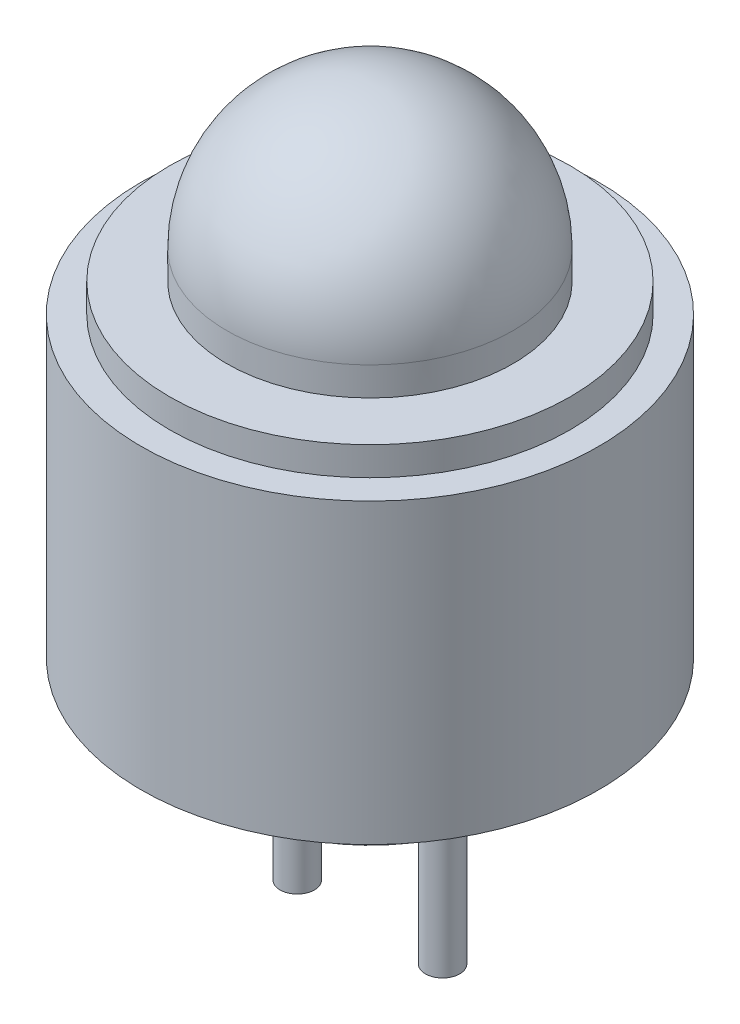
from build123d import *

# Parameters (mm, degrees)
SKETCH_2_R      = 0.3
EXTRUDE_1_DEPTH = 3


with BuildPart() as part:
    # Sketch 1 → Revolve 1 (revolve)
    with BuildSketch(Plane.XY, mode=Mode.PRIVATE) as revolve_1_sk:
        with BuildLine():
            Line((0, 0), (2.6, 0))
            Line((2.6, 0), (2.6, 1))
            Line((2.6, 1), (4, 1))
            Line((4, 1), (4, 6.2))
            Line((4, 6.2), (3.5, 6.2))
            Line((3.5, 6.2), (3.5, 6.7))
            Line((3.5, 6.7), (2.5, 6.7))
            Line((2.5, 6.7), (2.5, 7.2))
            ThreePointArc((2.5, 7.2), (1.767766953, 8.967766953), (0, 9.7))
            Line((0, 9.7), (0, 0))
        make_face()
    revolve(revolve_1_sk.sketch.rotate(Axis((0, 9.7, 0), (0, -1, 0)), 180), axis=Axis((0, 9.7, 0), (0, -1, 0)))

    # Sketch 2 → Extrude 1 (add)
    with BuildSketch(Plane.XZ):
        with Locations(Location((-1.27, 0, 0), (0, 0, 180))):
            Circle(SKETCH_2_R)
        with Locations(Location((1.27, 0, 0), (0, 0, 180))):
            Circle(SKETCH_2_R)
    extrude(amount=EXTRUDE_1_DEPTH)


solid = part.part
